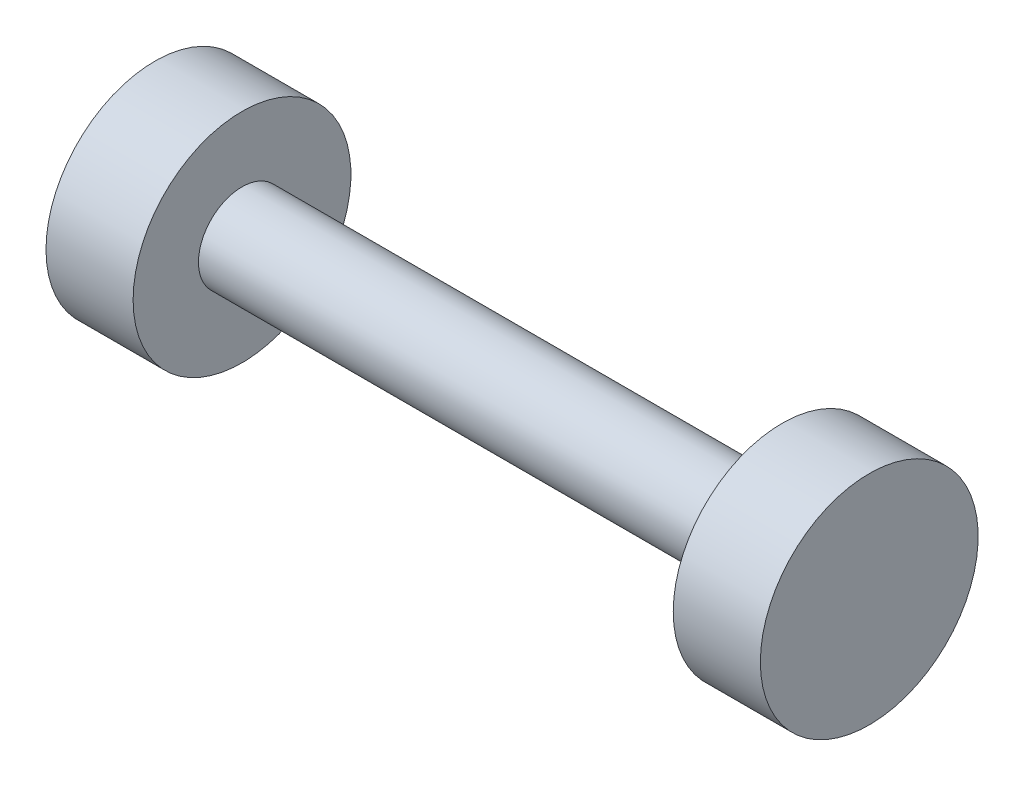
ISO-10303-21;
HEADER;
FILE_DESCRIPTION(('STEP AP214'),'2;1');
FILE_NAME('part.step','',(''),(''),'','','');
FILE_SCHEMA(('AUTOMOTIVE_DESIGN { 1 0 10303 214 1 1 1 1 }'));
ENDSEC;
DATA;
#1=APPLICATION_CONTEXT('core data for automotive mechanical design processes');
#2=APPLICATION_PROTOCOL_DEFINITION('international standard','automotive_design',2000,#1);
#3=PRODUCT_CONTEXT('',#1,'mechanical');
#4=PRODUCT('Part','Part','',(#3));
#5=PRODUCT_RELATED_PRODUCT_CATEGORY('part','',(#4));
#6=PRODUCT_DEFINITION_FORMATION('','',#4);
#7=PRODUCT_DEFINITION_CONTEXT('part definition',#1,'design');
#8=PRODUCT_DEFINITION('design','',#6,#7);
#9=PRODUCT_DEFINITION_SHAPE('','',#8);
#10=(LENGTH_UNIT() NAMED_UNIT(*) SI_UNIT(.MILLI.,.METRE.));
#11=(NAMED_UNIT(*) PLANE_ANGLE_UNIT() SI_UNIT($,.RADIAN.));
#12=(NAMED_UNIT(*) SI_UNIT($,.STERADIAN.) SOLID_ANGLE_UNIT());
#13=UNCERTAINTY_MEASURE_WITH_UNIT(LENGTH_MEASURE(1.E-05),#10,'distance_accuracy_value','');
#14=(GEOMETRIC_REPRESENTATION_CONTEXT(3) GLOBAL_UNCERTAINTY_ASSIGNED_CONTEXT((#13)) GLOBAL_UNIT_ASSIGNED_CONTEXT((#10,
#11,#12)) REPRESENTATION_CONTEXT('',''));
#15=CARTESIAN_POINT('',(0.,0.,0.));
#16=DIRECTION('',(0.,0.,1.));
#17=DIRECTION('',(1.,0.,0.));
#18=AXIS2_PLACEMENT_3D('',#15,#16,#17);
#19=CARTESIAN_POINT('',(8.2,2.50000000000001,0.));
#20=DIRECTION('',(-1.,0.,0.));
#21=DIRECTION('',(0.,0.,1.));
#22=AXIS2_PLACEMENT_3D('',#19,#20,#21);
#23=PLANE('',#22);
#24=CARTESIAN_POINT('',(8.2,0.,0.));
#25=DIRECTION('',(-1.,0.,0.));
#26=DIRECTION('',(0.,0.,1.));
#27=AXIS2_PLACEMENT_3D('',#24,#25,#26);
#28=CIRCLE('',#27,2.5);
#29=CARTESIAN_POINT('',(8.2,0.,2.5));
#30=VERTEX_POINT('',#29);
#31=EDGE_CURVE('E10',#30,#30,#28,.T.);
#32=ORIENTED_EDGE('',*,*,#31,.F.);
#33=EDGE_LOOP('',(#32));
#34=FACE_BOUND('',#33,.T.);
#35=ADVANCED_FACE('F24',(#34),#23,.F.);
#36=CARTESIAN_POINT('',(-31.619341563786,0.,0.));
#37=DIRECTION('',(-1.,0.,0.));
#38=DIRECTION('',(0.,0.,1.));
#39=AXIS2_PLACEMENT_3D('',#36,#37,#38);
#40=CYLINDRICAL_SURFACE('',#39,2.5);
#41=CARTESIAN_POINT('',(6.2,0.,0.));
#42=DIRECTION('',(-1.,0.,0.));
#43=DIRECTION('',(0.,0.,1.));
#44=AXIS2_PLACEMENT_3D('',#41,#42,#43);
#45=CIRCLE('',#44,2.49999999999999);
#46=CARTESIAN_POINT('',(6.2,0.,2.5));
#47=VERTEX_POINT('',#46);
#48=EDGE_CURVE('E30',#47,#47,#45,.T.);
#49=ORIENTED_EDGE('',*,*,#48,.F.);
#50=EDGE_LOOP('',(#49));
#51=FACE_BOUND('',#50,.T.);
#52=ORIENTED_EDGE('',*,*,#31,.T.);
#53=EDGE_LOOP('',(#52));
#54=FACE_BOUND('',#53,.T.);
#55=ADVANCED_FACE('F72',(#51,#54),#40,.T.);
#56=CARTESIAN_POINT('',(6.2,0.999999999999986,0.));
#57=DIRECTION('',(1.,0.,0.));
#58=DIRECTION('',(0.,0.,-1.));
#59=AXIS2_PLACEMENT_3D('',#56,#57,#58);
#60=PLANE('',#59);
#61=CARTESIAN_POINT('',(6.2,0.,0.));
#62=DIRECTION('',(-1.,0.,0.));
#63=DIRECTION('',(0.,0.,1.));
#64=AXIS2_PLACEMENT_3D('',#61,#62,#63);
#65=CIRCLE('',#64,0.99999999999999);
#66=CARTESIAN_POINT('',(6.2,0.,0.99999999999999));
#67=VERTEX_POINT('',#66);
#68=EDGE_CURVE('E34',#67,#67,#65,.T.);
#69=ORIENTED_EDGE('',*,*,#68,.F.);
#70=EDGE_LOOP('',(#69));
#71=FACE_BOUND('',#70,.T.);
#72=ORIENTED_EDGE('',*,*,#48,.T.);
#73=EDGE_LOOP('',(#72));
#74=FACE_BOUND('',#73,.T.);
#75=ADVANCED_FACE('F67',(#71,#74),#60,.F.);
#76=CARTESIAN_POINT('',(-31.619341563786,0.,0.));
#77=DIRECTION('',(-1.,0.,0.));
#78=DIRECTION('',(0.,0.,1.));
#79=AXIS2_PLACEMENT_3D('',#76,#77,#78);
#80=CYLINDRICAL_SURFACE('',#79,0.999999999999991);
#81=CARTESIAN_POINT('',(-6.2,0.,0.));
#82=DIRECTION('',(-1.,0.,0.));
#83=DIRECTION('',(0.,0.,1.));
#84=AXIS2_PLACEMENT_3D('',#81,#82,#83);
#85=CIRCLE('',#84,0.999999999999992);
#86=CARTESIAN_POINT('',(-6.2,0.,1.00000000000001));
#87=VERTEX_POINT('',#86);
#88=EDGE_CURVE('E38',#87,#87,#85,.T.);
#89=ORIENTED_EDGE('',*,*,#88,.F.);
#90=EDGE_LOOP('',(#89));
#91=FACE_BOUND('',#90,.T.);
#92=ORIENTED_EDGE('',*,*,#68,.T.);
#93=EDGE_LOOP('',(#92));
#94=FACE_BOUND('',#93,.T.);
#95=ADVANCED_FACE('F61',(#91,#94),#80,.T.);
#96=CARTESIAN_POINT('',(-6.2,2.5,0.));
#97=DIRECTION('',(-1.,0.,0.));
#98=DIRECTION('',(0.,0.,1.));
#99=AXIS2_PLACEMENT_3D('',#96,#97,#98);
#100=PLANE('',#99);
#101=CARTESIAN_POINT('',(-6.2,0.,0.));
#102=DIRECTION('',(-1.,0.,0.));
#103=DIRECTION('',(0.,0.,1.));
#104=AXIS2_PLACEMENT_3D('',#101,#102,#103);
#105=CIRCLE('',#104,2.5);
#106=CARTESIAN_POINT('',(-6.2,0.,2.50000000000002));
#107=VERTEX_POINT('',#106);
#108=EDGE_CURVE('E43',#107,#107,#105,.T.);
#109=ORIENTED_EDGE('',*,*,#108,.F.);
#110=EDGE_LOOP('',(#109));
#111=FACE_BOUND('',#110,.T.);
#112=ORIENTED_EDGE('',*,*,#88,.T.);
#113=EDGE_LOOP('',(#112));
#114=FACE_BOUND('',#113,.T.);
#115=ADVANCED_FACE('F55',(#111,#114),#100,.F.);
#116=CARTESIAN_POINT('',(-31.619341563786,0.,0.));
#117=DIRECTION('',(-1.,0.,0.));
#118=DIRECTION('',(0.,0.,1.));
#119=AXIS2_PLACEMENT_3D('',#116,#117,#118);
#120=CYLINDRICAL_SURFACE('',#119,2.5);
#121=CARTESIAN_POINT('',(-8.19999999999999,0.,0.));
#122=DIRECTION('',(-1.,0.,0.));
#123=DIRECTION('',(0.,0.,1.));
#124=AXIS2_PLACEMENT_3D('',#121,#122,#123);
#125=CIRCLE('',#124,2.5);
#126=CARTESIAN_POINT('',(-8.19999999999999,0.,2.50000000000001));
#127=VERTEX_POINT('',#126);
#128=EDGE_CURVE('E46',#127,#127,#125,.T.);
#129=ORIENTED_EDGE('',*,*,#128,.F.);
#130=EDGE_LOOP('',(#129));
#131=FACE_BOUND('',#130,.T.);
#132=ORIENTED_EDGE('',*,*,#108,.T.);
#133=EDGE_LOOP('',(#132));
#134=FACE_BOUND('',#133,.T.);
#135=ADVANCED_FACE('F52',(#131,#134),#120,.T.);
#136=CARTESIAN_POINT('',(-8.19999999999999,0.,0.));
#137=DIRECTION('',(1.,0.,0.));
#138=DIRECTION('',(0.,0.,-1.));
#139=AXIS2_PLACEMENT_3D('',#136,#137,#138);
#140=PLANE('',#139);
#141=ORIENTED_EDGE('',*,*,#128,.T.);
#142=EDGE_LOOP('',(#141));
#143=FACE_BOUND('',#142,.T.);
#144=ADVANCED_FACE('F50',(#143),#140,.F.);
#145=CLOSED_SHELL('',(#35,#55,#75,#95,#115,#135,#144));
#146=MANIFOLD_SOLID_BREP('B2',#145);
#147=ADVANCED_BREP_SHAPE_REPRESENTATION('',(#18,#146),#14);
#148=SHAPE_DEFINITION_REPRESENTATION(#9,#147);
ENDSEC;
END-ISO-10303-21;
